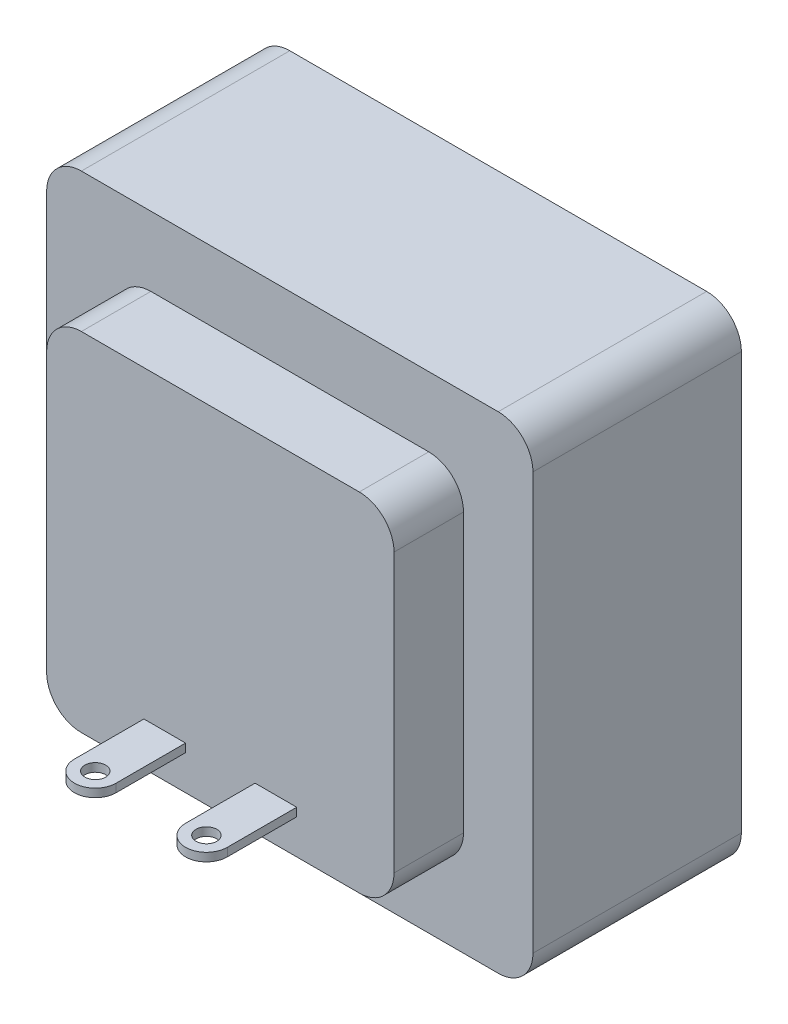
ISO-10303-21;
HEADER;
FILE_DESCRIPTION(('STEP AP214'),'2;1');
FILE_NAME('part.step','',(''),(''),'','','');
FILE_SCHEMA(('AUTOMOTIVE_DESIGN { 1 0 10303 214 1 1 1 1 }'));
ENDSEC;
DATA;
#1=APPLICATION_CONTEXT('core data for automotive mechanical design processes');
#2=APPLICATION_PROTOCOL_DEFINITION('international standard','automotive_design',2000,#1);
#3=PRODUCT_CONTEXT('',#1,'mechanical');
#4=PRODUCT('Part','Part','',(#3));
#5=PRODUCT_RELATED_PRODUCT_CATEGORY('part','',(#4));
#6=PRODUCT_DEFINITION_FORMATION('','',#4);
#7=PRODUCT_DEFINITION_CONTEXT('part definition',#1,'design');
#8=PRODUCT_DEFINITION('design','',#6,#7);
#9=PRODUCT_DEFINITION_SHAPE('','',#8);
#10=(LENGTH_UNIT() NAMED_UNIT(*) SI_UNIT(.MILLI.,.METRE.));
#11=(NAMED_UNIT(*) PLANE_ANGLE_UNIT() SI_UNIT($,.RADIAN.));
#12=(NAMED_UNIT(*) SI_UNIT($,.STERADIAN.) SOLID_ANGLE_UNIT());
#13=UNCERTAINTY_MEASURE_WITH_UNIT(LENGTH_MEASURE(1.E-05),#10,'distance_accuracy_value','');
#14=(GEOMETRIC_REPRESENTATION_CONTEXT(3) GLOBAL_UNCERTAINTY_ASSIGNED_CONTEXT((#13)) GLOBAL_UNIT_ASSIGNED_CONTEXT((#10,
#11,#12)) REPRESENTATION_CONTEXT('',''));
#15=CARTESIAN_POINT('',(0.,0.,0.));
#16=DIRECTION('',(0.,0.,1.));
#17=DIRECTION('',(1.,0.,0.));
#18=AXIS2_PLACEMENT_3D('',#15,#16,#17);
#19=CARTESIAN_POINT('',(67.1262806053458,15.875,15.875));
#20=DIRECTION('',(0.,0.,-1.));
#21=DIRECTION('',(-1.,0.,0.));
#22=AXIS2_PLACEMENT_3D('',#19,#20,#21);
#23=PLANE('',#22);
#24=DIRECTION('',(0.,-1.,0.));
#25=VECTOR('',#24,1.);
#26=CARTESIAN_POINT('',(-6.985,-12.7,15.875));
#27=LINE('',#26,#25);
#28=CARTESIAN_POINT('',(-6.985,-11.938,15.875));
#29=VERTEX_POINT('',#28);
#30=CARTESIAN_POINT('',(-6.985,-12.7,15.875));
#31=VERTEX_POINT('',#30);
#32=EDGE_CURVE('E300',#29,#31,#27,.T.);
#33=ORIENTED_EDGE('',*,*,#32,.F.);
#34=DIRECTION('',(-1.,0.,0.));
#35=VECTOR('',#34,1.);
#36=CARTESIAN_POINT('',(-6.985,-11.938,15.875));
#37=LINE('',#36,#35);
#38=CARTESIAN_POINT('',(-3.175,-11.938,15.875));
#39=VERTEX_POINT('',#38);
#40=EDGE_CURVE('E306',#39,#29,#37,.T.);
#41=ORIENTED_EDGE('',*,*,#40,.F.);
#42=DIRECTION('',(0.,1.,0.));
#43=VECTOR('',#42,1.);
#44=CARTESIAN_POINT('',(-3.175,-12.7,15.875));
#45=LINE('',#44,#43);
#46=CARTESIAN_POINT('',(-3.175,-12.7,15.875));
#47=VERTEX_POINT('',#46);
#48=EDGE_CURVE('E304',#47,#39,#45,.T.);
#49=ORIENTED_EDGE('',*,*,#48,.F.);
#50=DIRECTION('',(1.,0.,0.));
#51=VECTOR('',#50,1.);
#52=CARTESIAN_POINT('',(-6.985,-12.7,15.875));
#53=LINE('',#52,#51);
#54=EDGE_CURVE('E257',#31,#47,#53,.T.);
#55=ORIENTED_EDGE('',*,*,#54,.F.);
#56=EDGE_LOOP('',(#33,#41,#49,#55));
#57=FACE_BOUND('',#56,.T.);
#58=DIRECTION('',(0.,1.,0.));
#59=VECTOR('',#58,1.);
#60=CARTESIAN_POINT('',(-15.875,15.875,15.875));
#61=LINE('',#60,#59);
#62=CARTESIAN_POINT('',(-15.875,-12.7,15.875));
#63=VERTEX_POINT('',#62);
#64=CARTESIAN_POINT('',(-15.875,12.7,15.875));
#65=VERTEX_POINT('',#64);
#66=EDGE_CURVE('E317',#63,#65,#61,.T.);
#67=ORIENTED_EDGE('',*,*,#66,.F.);
#68=CARTESIAN_POINT('',(-12.7,-12.7,15.875));
#69=DIRECTION('',(0.,0.,-1.));
#70=DIRECTION('',(-1.,0.,0.));
#71=AXIS2_PLACEMENT_3D('',#68,#69,#70);
#72=CIRCLE('',#71,3.175);
#73=CARTESIAN_POINT('',(-12.7,-15.875,15.875));
#74=VERTEX_POINT('',#73);
#75=EDGE_CURVE('E448',#63,#74,#72,.F.);
#76=ORIENTED_EDGE('',*,*,#75,.T.);
#77=DIRECTION('',(-1.,0.,0.));
#78=VECTOR('',#77,1.);
#79=CARTESIAN_POINT('',(67.1262806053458,-15.875,15.875));
#80=LINE('',#79,#78);
#81=CARTESIAN_POINT('',(12.7,-15.875,15.875));
#82=VERTEX_POINT('',#81);
#83=EDGE_CURVE('E325',#82,#74,#80,.T.);
#84=ORIENTED_EDGE('',*,*,#83,.F.);
#85=CARTESIAN_POINT('',(12.7,-12.7,15.875));
#86=DIRECTION('',(0.,0.,-1.));
#87=DIRECTION('',(-1.,0.,0.));
#88=AXIS2_PLACEMENT_3D('',#85,#86,#87);
#89=CIRCLE('',#88,3.175);
#90=CARTESIAN_POINT('',(15.875,-12.7,15.875));
#91=VERTEX_POINT('',#90);
#92=EDGE_CURVE('E446',#82,#91,#89,.F.);
#93=ORIENTED_EDGE('',*,*,#92,.T.);
#94=DIRECTION('',(0.,1.,0.));
#95=VECTOR('',#94,1.);
#96=CARTESIAN_POINT('',(15.875,15.875,15.875));
#97=LINE('',#96,#95);
#98=CARTESIAN_POINT('',(15.875,12.7,15.875));
#99=VERTEX_POINT('',#98);
#100=EDGE_CURVE('E324',#91,#99,#97,.T.);
#101=ORIENTED_EDGE('',*,*,#100,.T.);
#102=CARTESIAN_POINT('',(12.7,12.7,15.875));
#103=DIRECTION('',(0.,0.,-1.));
#104=DIRECTION('',(-1.,0.,0.));
#105=AXIS2_PLACEMENT_3D('',#102,#103,#104);
#106=CIRCLE('',#105,3.175);
#107=CARTESIAN_POINT('',(12.7,15.875,15.875));
#108=VERTEX_POINT('',#107);
#109=EDGE_CURVE('E442',#99,#108,#106,.F.);
#110=ORIENTED_EDGE('',*,*,#109,.T.);
#111=DIRECTION('',(-1.,0.,0.));
#112=VECTOR('',#111,1.);
#113=CARTESIAN_POINT('',(67.1262806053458,15.875,15.875));
#114=LINE('',#113,#112);
#115=CARTESIAN_POINT('',(-12.7,15.875,15.875));
#116=VERTEX_POINT('',#115);
#117=EDGE_CURVE('E320',#108,#116,#114,.T.);
#118=ORIENTED_EDGE('',*,*,#117,.T.);
#119=CARTESIAN_POINT('',(-12.7,12.7,15.875));
#120=DIRECTION('',(0.,0.,-1.));
#121=DIRECTION('',(-1.,0.,0.));
#122=AXIS2_PLACEMENT_3D('',#119,#120,#121);
#123=CIRCLE('',#122,3.175);
#124=EDGE_CURVE('E444',#116,#65,#123,.F.);
#125=ORIENTED_EDGE('',*,*,#124,.T.);
#126=EDGE_LOOP('',(#67,#76,#84,#93,#101,#110,#118,#125));
#127=FACE_BOUND('',#126,.T.);
#128=DIRECTION('',(1.,0.,0.));
#129=VECTOR('',#128,1.);
#130=CARTESIAN_POINT('',(6.985,-12.7,15.875));
#131=LINE('',#130,#129);
#132=CARTESIAN_POINT('',(3.175,-12.7,15.875));
#133=VERTEX_POINT('',#132);
#134=CARTESIAN_POINT('',(6.985,-12.7,15.875));
#135=VERTEX_POINT('',#134);
#136=EDGE_CURVE('E274',#133,#135,#131,.T.);
#137=ORIENTED_EDGE('',*,*,#136,.F.);
#138=DIRECTION('',(0.,-1.,0.));
#139=VECTOR('',#138,1.);
#140=CARTESIAN_POINT('',(3.175,-12.7,15.875));
#141=LINE('',#140,#139);
#142=CARTESIAN_POINT('',(3.175,-11.938,15.875));
#143=VERTEX_POINT('',#142);
#144=EDGE_CURVE('E280',#143,#133,#141,.T.);
#145=ORIENTED_EDGE('',*,*,#144,.F.);
#146=DIRECTION('',(-1.,0.,0.));
#147=VECTOR('',#146,1.);
#148=CARTESIAN_POINT('',(6.985,-11.938,15.875));
#149=LINE('',#148,#147);
#150=CARTESIAN_POINT('',(6.985,-11.938,15.875));
#151=VERTEX_POINT('',#150);
#152=EDGE_CURVE('E50',#151,#143,#149,.T.);
#153=ORIENTED_EDGE('',*,*,#152,.F.);
#154=DIRECTION('',(0.,1.,0.));
#155=VECTOR('',#154,1.);
#156=CARTESIAN_POINT('',(6.985,-12.7,15.875));
#157=LINE('',#156,#155);
#158=EDGE_CURVE('E45',#135,#151,#157,.T.);
#159=ORIENTED_EDGE('',*,*,#158,.F.);
#160=EDGE_LOOP('',(#137,#145,#153,#159));
#161=FACE_BOUND('',#160,.T.);
#162=ADVANCED_FACE('F30',(#57,#127,#161),#23,.F.);
#163=CARTESIAN_POINT('',(-22.225,-22.225,9.525));
#164=DIRECTION('',(0.,0.,1.));
#165=DIRECTION('',(1.,0.,0.));
#166=AXIS2_PLACEMENT_3D('',#163,#164,#165);
#167=PLANE('',#166);
#168=DIRECTION('',(0.,-1.,0.));
#169=VECTOR('',#168,1.);
#170=CARTESIAN_POINT('',(-22.225,22.225,9.525));
#171=LINE('',#170,#169);
#172=CARTESIAN_POINT('',(-22.225,19.05,9.525));
#173=VERTEX_POINT('',#172);
#174=CARTESIAN_POINT('',(-22.225,-19.05,9.525));
#175=VERTEX_POINT('',#174);
#176=EDGE_CURVE('E362',#173,#175,#171,.T.);
#177=ORIENTED_EDGE('',*,*,#176,.T.);
#178=CARTESIAN_POINT('',(-19.05,-19.05,9.525));
#179=DIRECTION('',(0.,0.,1.));
#180=DIRECTION('',(1.,0.,0.));
#181=AXIS2_PLACEMENT_3D('',#178,#179,#180);
#182=CIRCLE('',#181,3.175);
#183=CARTESIAN_POINT('',(-19.05,-22.225,9.525));
#184=VERTEX_POINT('',#183);
#185=EDGE_CURVE('E410',#175,#184,#182,.T.);
#186=ORIENTED_EDGE('',*,*,#185,.T.);
#187=DIRECTION('',(1.,0.,0.));
#188=VECTOR('',#187,1.);
#189=CARTESIAN_POINT('',(-22.225,-22.225,9.525));
#190=LINE('',#189,#188);
#191=CARTESIAN_POINT('',(19.05,-22.225,9.525));
#192=VERTEX_POINT('',#191);
#193=EDGE_CURVE('E365',#184,#192,#190,.T.);
#194=ORIENTED_EDGE('',*,*,#193,.T.);
#195=CARTESIAN_POINT('',(19.05,-19.05,9.525));
#196=DIRECTION('',(0.,0.,1.));
#197=DIRECTION('',(1.,0.,0.));
#198=AXIS2_PLACEMENT_3D('',#195,#196,#197);
#199=CIRCLE('',#198,3.175);
#200=CARTESIAN_POINT('',(22.225,-19.05,9.525));
#201=VERTEX_POINT('',#200);
#202=EDGE_CURVE('E408',#192,#201,#199,.T.);
#203=ORIENTED_EDGE('',*,*,#202,.T.);
#204=DIRECTION('',(0.,1.,0.));
#205=VECTOR('',#204,1.);
#206=CARTESIAN_POINT('',(22.225,22.225,9.525));
#207=LINE('',#206,#205);
#208=CARTESIAN_POINT('',(22.225,19.05,9.525));
#209=VERTEX_POINT('',#208);
#210=EDGE_CURVE('E368',#201,#209,#207,.T.);
#211=ORIENTED_EDGE('',*,*,#210,.T.);
#212=CARTESIAN_POINT('',(19.05,19.05,9.525));
#213=DIRECTION('',(0.,0.,1.));
#214=DIRECTION('',(1.,0.,0.));
#215=AXIS2_PLACEMENT_3D('',#212,#213,#214);
#216=CIRCLE('',#215,3.175);
#217=CARTESIAN_POINT('',(19.05,22.225,9.525));
#218=VERTEX_POINT('',#217);
#219=EDGE_CURVE('E404',#209,#218,#216,.T.);
#220=ORIENTED_EDGE('',*,*,#219,.T.);
#221=DIRECTION('',(-1.,0.,0.));
#222=VECTOR('',#221,1.);
#223=CARTESIAN_POINT('',(-22.225,22.225,9.525));
#224=LINE('',#223,#222);
#225=CARTESIAN_POINT('',(-19.05,22.225,9.525));
#226=VERTEX_POINT('',#225);
#227=EDGE_CURVE('E371',#218,#226,#224,.T.);
#228=ORIENTED_EDGE('',*,*,#227,.T.);
#229=CARTESIAN_POINT('',(-19.05,19.05,9.525));
#230=DIRECTION('',(0.,0.,1.));
#231=DIRECTION('',(1.,0.,0.));
#232=AXIS2_PLACEMENT_3D('',#229,#230,#231);
#233=CIRCLE('',#232,3.175);
#234=EDGE_CURVE('E406',#226,#173,#233,.T.);
#235=ORIENTED_EDGE('',*,*,#234,.T.);
#236=EDGE_LOOP('',(#177,#186,#194,#203,#211,#220,#228,#235));
#237=FACE_BOUND('',#236,.T.);
#238=DIRECTION('',(0.,1.,0.));
#239=VECTOR('',#238,1.);
#240=CARTESIAN_POINT('',(-15.875,-22.225,9.525));
#241=LINE('',#240,#239);
#242=CARTESIAN_POINT('',(-15.875,-12.7,9.525));
#243=VERTEX_POINT('',#242);
#244=CARTESIAN_POINT('',(-15.875,12.7,9.525));
#245=VERTEX_POINT('',#244);
#246=EDGE_CURVE('E328',#243,#245,#241,.T.);
#247=ORIENTED_EDGE('',*,*,#246,.T.);
#248=CARTESIAN_POINT('',(-12.7,12.7,9.525));
#249=DIRECTION('',(0.,0.,1.));
#250=DIRECTION('',(1.,0.,0.));
#251=AXIS2_PLACEMENT_3D('',#248,#249,#250);
#252=CIRCLE('',#251,3.175);
#253=CARTESIAN_POINT('',(-12.7,15.875,9.525));
#254=VERTEX_POINT('',#253);
#255=EDGE_CURVE('E488',#245,#254,#252,.F.);
#256=ORIENTED_EDGE('',*,*,#255,.T.);
#257=DIRECTION('',(1.,0.,0.));
#258=VECTOR('',#257,1.);
#259=CARTESIAN_POINT('',(-22.225,15.875,9.525));
#260=LINE('',#259,#258);
#261=CARTESIAN_POINT('',(12.7,15.875,9.525));
#262=VERTEX_POINT('',#261);
#263=EDGE_CURVE('E347',#254,#262,#260,.T.);
#264=ORIENTED_EDGE('',*,*,#263,.T.);
#265=CARTESIAN_POINT('',(12.7,12.7,9.525));
#266=DIRECTION('',(0.,0.,1.));
#267=DIRECTION('',(1.,0.,0.));
#268=AXIS2_PLACEMENT_3D('',#265,#266,#267);
#269=CIRCLE('',#268,3.175);
#270=CARTESIAN_POINT('',(15.875,12.7,9.525));
#271=VERTEX_POINT('',#270);
#272=EDGE_CURVE('E38',#262,#271,#269,.F.);
#273=ORIENTED_EDGE('',*,*,#272,.T.);
#274=DIRECTION('',(0.,-1.,0.));
#275=VECTOR('',#274,1.);
#276=CARTESIAN_POINT('',(15.875,-22.225,9.525));
#277=LINE('',#276,#275);
#278=CARTESIAN_POINT('',(15.875,-12.7,9.525));
#279=VERTEX_POINT('',#278);
#280=EDGE_CURVE('E341',#271,#279,#277,.T.);
#281=ORIENTED_EDGE('',*,*,#280,.T.);
#282=CARTESIAN_POINT('',(12.7,-12.7,9.525));
#283=DIRECTION('',(0.,0.,1.));
#284=DIRECTION('',(1.,0.,0.));
#285=AXIS2_PLACEMENT_3D('',#282,#283,#284);
#286=CIRCLE('',#285,3.175);
#287=CARTESIAN_POINT('',(12.7,-15.875,9.525));
#288=VERTEX_POINT('',#287);
#289=EDGE_CURVE('E484',#279,#288,#286,.F.);
#290=ORIENTED_EDGE('',*,*,#289,.T.);
#291=DIRECTION('',(-1.,0.,0.));
#292=VECTOR('',#291,1.);
#293=CARTESIAN_POINT('',(-22.225,-15.875,9.525));
#294=LINE('',#293,#292);
#295=CARTESIAN_POINT('',(-12.7,-15.875,9.525));
#296=VERTEX_POINT('',#295);
#297=EDGE_CURVE('E344',#288,#296,#294,.T.);
#298=ORIENTED_EDGE('',*,*,#297,.T.);
#299=CARTESIAN_POINT('',(-12.7,-12.7,9.525));
#300=DIRECTION('',(0.,0.,1.));
#301=DIRECTION('',(1.,0.,0.));
#302=AXIS2_PLACEMENT_3D('',#299,#300,#301);
#303=CIRCLE('',#302,3.175);
#304=EDGE_CURVE('E480',#296,#243,#303,.F.);
#305=ORIENTED_EDGE('',*,*,#304,.T.);
#306=EDGE_LOOP('',(#247,#256,#264,#273,#281,#290,#298,#305));
#307=FACE_BOUND('',#306,.T.);
#308=ADVANCED_FACE('F491',(#237,#307),#167,.T.);
#309=CARTESIAN_POINT('',(-22.225,-22.225,-9.525));
#310=DIRECTION('',(0.,0.,1.));
#311=DIRECTION('',(1.,0.,0.));
#312=AXIS2_PLACEMENT_3D('',#309,#310,#311);
#313=PLANE('',#312);
#314=DIRECTION('',(1.,0.,0.));
#315=VECTOR('',#314,1.);
#316=CARTESIAN_POINT('',(-22.225,-22.225,-9.525));
#317=LINE('',#316,#315);
#318=CARTESIAN_POINT('',(-19.05,-22.225,-9.525));
#319=VERTEX_POINT('',#318);
#320=CARTESIAN_POINT('',(19.05,-22.225,-9.525));
#321=VERTEX_POINT('',#320);
#322=EDGE_CURVE('E353',#319,#321,#317,.T.);
#323=ORIENTED_EDGE('',*,*,#322,.F.);
#324=CARTESIAN_POINT('',(-19.05,-19.05,-9.525));
#325=DIRECTION('',(0.,0.,1.));
#326=DIRECTION('',(1.,0.,0.));
#327=AXIS2_PLACEMENT_3D('',#324,#325,#326);
#328=CIRCLE('',#327,3.175);
#329=CARTESIAN_POINT('',(-22.225,-19.05,-9.525));
#330=VERTEX_POINT('',#329);
#331=EDGE_CURVE('E397',#319,#330,#328,.F.);
#332=ORIENTED_EDGE('',*,*,#331,.T.);
#333=DIRECTION('',(0.,-1.,0.));
#334=VECTOR('',#333,1.);
#335=CARTESIAN_POINT('',(-22.225,22.225,-9.525));
#336=LINE('',#335,#334);
#337=CARTESIAN_POINT('',(-22.225,19.05,-9.525));
#338=VERTEX_POINT('',#337);
#339=EDGE_CURVE('E350',#338,#330,#336,.T.);
#340=ORIENTED_EDGE('',*,*,#339,.F.);
#341=CARTESIAN_POINT('',(-19.05,19.05,-9.525));
#342=DIRECTION('',(0.,0.,1.));
#343=DIRECTION('',(1.,0.,0.));
#344=AXIS2_PLACEMENT_3D('',#341,#342,#343);
#345=CIRCLE('',#344,3.175);
#346=CARTESIAN_POINT('',(-19.05,22.225,-9.525));
#347=VERTEX_POINT('',#346);
#348=EDGE_CURVE('E393',#338,#347,#345,.F.);
#349=ORIENTED_EDGE('',*,*,#348,.T.);
#350=DIRECTION('',(-1.,0.,0.));
#351=VECTOR('',#350,1.);
#352=CARTESIAN_POINT('',(-22.225,22.225,-9.525));
#353=LINE('',#352,#351);
#354=CARTESIAN_POINT('',(19.05,22.225,-9.525));
#355=VERTEX_POINT('',#354);
#356=EDGE_CURVE('E359',#355,#347,#353,.T.);
#357=ORIENTED_EDGE('',*,*,#356,.F.);
#358=CARTESIAN_POINT('',(19.05,19.05,-9.525));
#359=DIRECTION('',(0.,0.,1.));
#360=DIRECTION('',(1.,0.,0.));
#361=AXIS2_PLACEMENT_3D('',#358,#359,#360);
#362=CIRCLE('',#361,3.175);
#363=CARTESIAN_POINT('',(22.225,19.05,-9.525));
#364=VERTEX_POINT('',#363);
#365=EDGE_CURVE('E391',#355,#364,#362,.F.);
#366=ORIENTED_EDGE('',*,*,#365,.T.);
#367=DIRECTION('',(0.,1.,0.));
#368=VECTOR('',#367,1.);
#369=CARTESIAN_POINT('',(22.225,22.225,-9.525));
#370=LINE('',#369,#368);
#371=CARTESIAN_POINT('',(22.225,-19.05,-9.525));
#372=VERTEX_POINT('',#371);
#373=EDGE_CURVE('E356',#372,#364,#370,.T.);
#374=ORIENTED_EDGE('',*,*,#373,.F.);
#375=CARTESIAN_POINT('',(19.05,-19.05,-9.525));
#376=DIRECTION('',(0.,0.,1.));
#377=DIRECTION('',(1.,0.,0.));
#378=AXIS2_PLACEMENT_3D('',#375,#376,#377);
#379=CIRCLE('',#378,3.175);
#380=EDGE_CURVE('E395',#372,#321,#379,.F.);
#381=ORIENTED_EDGE('',*,*,#380,.T.);
#382=EDGE_LOOP('',(#323,#332,#340,#349,#357,#366,#374,#381));
#383=FACE_BOUND('',#382,.T.);
#384=DIRECTION('',(0.,-1.,0.));
#385=VECTOR('',#384,1.);
#386=CARTESIAN_POINT('',(15.875,-22.225,-9.525));
#387=LINE('',#386,#385);
#388=CARTESIAN_POINT('',(15.875,12.7,-9.525));
#389=VERTEX_POINT('',#388);
#390=CARTESIAN_POINT('',(15.875,-12.7,-9.525));
#391=VERTEX_POINT('',#390);
#392=EDGE_CURVE('E383',#389,#391,#387,.T.);
#393=ORIENTED_EDGE('',*,*,#392,.F.);
#394=CARTESIAN_POINT('',(12.7,12.7,-9.525));
#395=DIRECTION('',(0.,0.,1.));
#396=DIRECTION('',(1.,0.,0.));
#397=AXIS2_PLACEMENT_3D('',#394,#395,#396);
#398=CIRCLE('',#397,3.175);
#399=CARTESIAN_POINT('',(12.7,15.875,-9.525));
#400=VERTEX_POINT('',#399);
#401=EDGE_CURVE('E12',#389,#400,#398,.T.);
#402=ORIENTED_EDGE('',*,*,#401,.T.);
#403=DIRECTION('',(1.,0.,0.));
#404=VECTOR('',#403,1.);
#405=CARTESIAN_POINT('',(-22.225,15.875,-9.525));
#406=LINE('',#405,#404);
#407=CARTESIAN_POINT('',(-12.7,15.875,-9.525));
#408=VERTEX_POINT('',#407);
#409=EDGE_CURVE('E380',#408,#400,#406,.T.);
#410=ORIENTED_EDGE('',*,*,#409,.F.);
#411=CARTESIAN_POINT('',(-12.7,12.7,-9.525));
#412=DIRECTION('',(0.,0.,1.));
#413=DIRECTION('',(1.,0.,0.));
#414=AXIS2_PLACEMENT_3D('',#411,#412,#413);
#415=CIRCLE('',#414,3.175);
#416=CARTESIAN_POINT('',(-15.875,12.7,-9.525));
#417=VERTEX_POINT('',#416);
#418=EDGE_CURVE('E486',#408,#417,#415,.T.);
#419=ORIENTED_EDGE('',*,*,#418,.T.);
#420=DIRECTION('',(0.,1.,0.));
#421=VECTOR('',#420,1.);
#422=CARTESIAN_POINT('',(-15.875,-22.225,-9.525));
#423=LINE('',#422,#421);
#424=CARTESIAN_POINT('',(-15.875,-12.7,-9.525));
#425=VERTEX_POINT('',#424);
#426=EDGE_CURVE('E374',#425,#417,#423,.T.);
#427=ORIENTED_EDGE('',*,*,#426,.F.);
#428=CARTESIAN_POINT('',(-12.7,-12.7,-9.525));
#429=DIRECTION('',(0.,0.,1.));
#430=DIRECTION('',(1.,0.,0.));
#431=AXIS2_PLACEMENT_3D('',#428,#429,#430);
#432=CIRCLE('',#431,3.175);
#433=CARTESIAN_POINT('',(-12.7,-15.875,-9.525));
#434=VERTEX_POINT('',#433);
#435=EDGE_CURVE('E478',#425,#434,#432,.T.);
#436=ORIENTED_EDGE('',*,*,#435,.T.);
#437=DIRECTION('',(-1.,0.,0.));
#438=VECTOR('',#437,1.);
#439=CARTESIAN_POINT('',(-22.225,-15.875,-9.525));
#440=LINE('',#439,#438);
#441=CARTESIAN_POINT('',(12.7,-15.875,-9.525));
#442=VERTEX_POINT('',#441);
#443=EDGE_CURVE('E377',#442,#434,#440,.T.);
#444=ORIENTED_EDGE('',*,*,#443,.F.);
#445=CARTESIAN_POINT('',(12.7,-12.7,-9.525));
#446=DIRECTION('',(0.,0.,1.));
#447=DIRECTION('',(1.,0.,0.));
#448=AXIS2_PLACEMENT_3D('',#445,#446,#447);
#449=CIRCLE('',#448,3.175);
#450=EDGE_CURVE('E482',#442,#391,#449,.T.);
#451=ORIENTED_EDGE('',*,*,#450,.T.);
#452=EDGE_LOOP('',(#393,#402,#410,#419,#427,#436,#444,#451));
#453=FACE_BOUND('',#452,.T.);
#454=ADVANCED_FACE('F549',(#383,#453),#313,.F.);
#455=CARTESIAN_POINT('',(-22.225,22.225,9.525));
#456=DIRECTION('',(1.,0.,0.));
#457=DIRECTION('',(0.,1.,0.));
#458=AXIS2_PLACEMENT_3D('',#455,#456,#457);
#459=PLANE('',#458);
#460=ORIENTED_EDGE('',*,*,#339,.T.);
#461=DIRECTION('',(0.,0.,-1.));
#462=VECTOR('',#461,1.);
#463=CARTESIAN_POINT('',(-22.225,-19.05,9.525));
#464=LINE('',#463,#462);
#465=EDGE_CURVE('E402',#330,#175,#464,.F.);
#466=ORIENTED_EDGE('',*,*,#465,.T.);
#467=ORIENTED_EDGE('',*,*,#176,.F.);
#468=DIRECTION('',(0.,0.,-1.));
#469=VECTOR('',#468,1.);
#470=CARTESIAN_POINT('',(-22.225,19.05,9.525));
#471=LINE('',#470,#469);
#472=EDGE_CURVE('E399',#173,#338,#471,.T.);
#473=ORIENTED_EDGE('',*,*,#472,.T.);
#474=EDGE_LOOP('',(#460,#466,#467,#473));
#475=FACE_BOUND('',#474,.T.);
#476=ADVANCED_FACE('F32',(#475),#459,.F.);
#477=CARTESIAN_POINT('',(-22.225,-22.225,9.525));
#478=DIRECTION('',(0.,1.,0.));
#479=DIRECTION('',(-1.,0.,0.));
#480=AXIS2_PLACEMENT_3D('',#477,#478,#479);
#481=PLANE('',#480);
#482=ORIENTED_EDGE('',*,*,#193,.F.);
#483=DIRECTION('',(0.,0.,-1.));
#484=VECTOR('',#483,1.);
#485=CARTESIAN_POINT('',(-19.05,-22.225,9.525));
#486=LINE('',#485,#484);
#487=EDGE_CURVE('E388',#184,#319,#486,.T.);
#488=ORIENTED_EDGE('',*,*,#487,.T.);
#489=ORIENTED_EDGE('',*,*,#322,.T.);
#490=DIRECTION('',(0.,0.,-1.));
#491=VECTOR('',#490,1.);
#492=CARTESIAN_POINT('',(19.05,-22.225,9.525));
#493=LINE('',#492,#491);
#494=EDGE_CURVE('E386',#321,#192,#493,.F.);
#495=ORIENTED_EDGE('',*,*,#494,.T.);
#496=EDGE_LOOP('',(#482,#488,#489,#495));
#497=FACE_BOUND('',#496,.T.);
#498=ADVANCED_FACE('F565',(#497),#481,.F.);
#499=CARTESIAN_POINT('',(22.225,22.225,9.525));
#500=DIRECTION('',(-1.,0.,0.));
#501=DIRECTION('',(0.,-1.,0.));
#502=AXIS2_PLACEMENT_3D('',#499,#500,#501);
#503=PLANE('',#502);
#504=ORIENTED_EDGE('',*,*,#210,.F.);
#505=DIRECTION('',(0.,0.,-1.));
#506=VECTOR('',#505,1.);
#507=CARTESIAN_POINT('',(22.225,-19.05,9.525));
#508=LINE('',#507,#506);
#509=EDGE_CURVE('E414',#201,#372,#508,.T.);
#510=ORIENTED_EDGE('',*,*,#509,.T.);
#511=ORIENTED_EDGE('',*,*,#373,.T.);
#512=DIRECTION('',(0.,0.,-1.));
#513=VECTOR('',#512,1.);
#514=CARTESIAN_POINT('',(22.225,19.05,9.525));
#515=LINE('',#514,#513);
#516=EDGE_CURVE('E412',#364,#209,#515,.F.);
#517=ORIENTED_EDGE('',*,*,#516,.T.);
#518=EDGE_LOOP('',(#504,#510,#511,#517));
#519=FACE_BOUND('',#518,.T.);
#520=ADVANCED_FACE('F562',(#519),#503,.F.);
#521=CARTESIAN_POINT('',(-22.225,22.225,9.525));
#522=DIRECTION('',(0.,-1.,0.));
#523=DIRECTION('',(0.,0.,-1.));
#524=AXIS2_PLACEMENT_3D('',#521,#522,#523);
#525=PLANE('',#524);
#526=ORIENTED_EDGE('',*,*,#356,.T.);
#527=DIRECTION('',(0.,0.,-1.));
#528=VECTOR('',#527,1.);
#529=CARTESIAN_POINT('',(-19.05,22.225,9.525));
#530=LINE('',#529,#528);
#531=EDGE_CURVE('E471',#347,#226,#530,.F.);
#532=ORIENTED_EDGE('',*,*,#531,.T.);
#533=ORIENTED_EDGE('',*,*,#227,.F.);
#534=DIRECTION('',(0.,0.,-1.));
#535=VECTOR('',#534,1.);
#536=CARTESIAN_POINT('',(19.05,22.225,9.525));
#537=LINE('',#536,#535);
#538=EDGE_CURVE('E468',#218,#355,#537,.T.);
#539=ORIENTED_EDGE('',*,*,#538,.T.);
#540=EDGE_LOOP('',(#526,#532,#533,#539));
#541=FACE_BOUND('',#540,.T.);
#542=ADVANCED_FACE('F558',(#541),#525,.F.);
#543=CARTESIAN_POINT('',(67.1262806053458,15.875,-15.875));
#544=DIRECTION('',(0.,0.,1.));
#545=DIRECTION('',(0.,-1.,0.));
#546=AXIS2_PLACEMENT_3D('',#543,#544,#545);
#547=PLANE('',#546);
#548=DIRECTION('',(-1.,0.,0.));
#549=VECTOR('',#548,1.);
#550=CARTESIAN_POINT('',(67.1262806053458,-15.875,-15.875));
#551=LINE('',#550,#549);
#552=CARTESIAN_POINT('',(12.7,-15.875,-15.875));
#553=VERTEX_POINT('',#552);
#554=CARTESIAN_POINT('',(-12.7,-15.875,-15.875));
#555=VERTEX_POINT('',#554);
#556=EDGE_CURVE('E334',#553,#555,#551,.T.);
#557=ORIENTED_EDGE('',*,*,#556,.T.);
#558=CARTESIAN_POINT('',(-12.7,-12.7,-15.875));
#559=DIRECTION('',(0.,0.,1.));
#560=DIRECTION('',(0.,-1.,0.));
#561=AXIS2_PLACEMENT_3D('',#558,#559,#560);
#562=CIRCLE('',#561,3.175);
#563=CARTESIAN_POINT('',(-15.875,-12.7,-15.875));
#564=VERTEX_POINT('',#563);
#565=EDGE_CURVE('E434',#555,#564,#562,.F.);
#566=ORIENTED_EDGE('',*,*,#565,.T.);
#567=DIRECTION('',(0.,-1.,0.));
#568=VECTOR('',#567,1.);
#569=CARTESIAN_POINT('',(-15.875,15.875,-15.875));
#570=LINE('',#569,#568);
#571=CARTESIAN_POINT('',(-15.875,12.7,-15.875));
#572=VERTEX_POINT('',#571);
#573=EDGE_CURVE('E314',#572,#564,#570,.T.);
#574=ORIENTED_EDGE('',*,*,#573,.F.);
#575=CARTESIAN_POINT('',(-12.7,12.7,-15.875));
#576=DIRECTION('',(0.,0.,1.));
#577=DIRECTION('',(0.,-1.,0.));
#578=AXIS2_PLACEMENT_3D('',#575,#576,#577);
#579=CIRCLE('',#578,3.175);
#580=CARTESIAN_POINT('',(-12.7,15.875,-15.875));
#581=VERTEX_POINT('',#580);
#582=EDGE_CURVE('E430',#572,#581,#579,.F.);
#583=ORIENTED_EDGE('',*,*,#582,.T.);
#584=DIRECTION('',(-1.,0.,0.));
#585=VECTOR('',#584,1.);
#586=CARTESIAN_POINT('',(67.1262806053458,15.875,-15.875));
#587=LINE('',#586,#585);
#588=CARTESIAN_POINT('',(12.7,15.875,-15.875));
#589=VERTEX_POINT('',#588);
#590=EDGE_CURVE('E331',#589,#581,#587,.T.);
#591=ORIENTED_EDGE('',*,*,#590,.F.);
#592=CARTESIAN_POINT('',(12.7,12.7,-15.875));
#593=DIRECTION('',(0.,0.,1.));
#594=DIRECTION('',(0.,-1.,0.));
#595=AXIS2_PLACEMENT_3D('',#592,#593,#594);
#596=CIRCLE('',#595,3.175);
#597=CARTESIAN_POINT('',(15.875,12.7,-15.875));
#598=VERTEX_POINT('',#597);
#599=EDGE_CURVE('E428',#589,#598,#596,.F.);
#600=ORIENTED_EDGE('',*,*,#599,.T.);
#601=DIRECTION('',(0.,-1.,0.));
#602=VECTOR('',#601,1.);
#603=CARTESIAN_POINT('',(15.875,15.875,-15.875));
#604=LINE('',#603,#602);
#605=CARTESIAN_POINT('',(15.875,-12.7,-15.875));
#606=VERTEX_POINT('',#605);
#607=EDGE_CURVE('E321',#598,#606,#604,.T.);
#608=ORIENTED_EDGE('',*,*,#607,.T.);
#609=CARTESIAN_POINT('',(12.7,-12.7,-15.875));
#610=DIRECTION('',(0.,0.,1.));
#611=DIRECTION('',(0.,-1.,0.));
#612=AXIS2_PLACEMENT_3D('',#609,#610,#611);
#613=CIRCLE('',#612,3.175);
#614=EDGE_CURVE('E432',#606,#553,#613,.F.);
#615=ORIENTED_EDGE('',*,*,#614,.T.);
#616=EDGE_LOOP('',(#557,#566,#574,#583,#591,#600,#608,#615));
#617=FACE_BOUND('',#616,.T.);
#618=ADVANCED_FACE('F561',(#617),#547,.F.);
#619=CARTESIAN_POINT('',(-15.875,22.225,9.525));
#620=DIRECTION('',(1.,0.,0.));
#621=DIRECTION('',(0.,1.,0.));
#622=AXIS2_PLACEMENT_3D('',#619,#620,#621);
#623=PLANE('',#622);
#624=ORIENTED_EDGE('',*,*,#573,.T.);
#625=DIRECTION('',(0.,0.,1.));
#626=VECTOR('',#625,1.);
#627=CARTESIAN_POINT('',(-15.875,-12.7,9.525));
#628=LINE('',#627,#626);
#629=EDGE_CURVE('E420',#564,#425,#628,.T.);
#630=ORIENTED_EDGE('',*,*,#629,.T.);
#631=ORIENTED_EDGE('',*,*,#426,.T.);
#632=DIRECTION('',(0.,0.,-1.));
#633=VECTOR('',#632,1.);
#634=CARTESIAN_POINT('',(-15.875,12.7,9.525));
#635=LINE('',#634,#633);
#636=EDGE_CURVE('E417',#417,#572,#635,.T.);
#637=ORIENTED_EDGE('',*,*,#636,.T.);
#638=EDGE_LOOP('',(#624,#630,#631,#637));
#639=FACE_BOUND('',#638,.T.);
#640=ADVANCED_FACE('F615',(#639),#623,.F.);
#641=CARTESIAN_POINT('',(15.875,22.225,9.525));
#642=DIRECTION('',(-1.,0.,0.));
#643=DIRECTION('',(0.,-1.,0.));
#644=AXIS2_PLACEMENT_3D('',#641,#642,#643);
#645=PLANE('',#644);
#646=ORIENTED_EDGE('',*,*,#392,.T.);
#647=DIRECTION('',(0.,0.,1.));
#648=VECTOR('',#647,1.);
#649=CARTESIAN_POINT('',(15.875,-12.7,9.525));
#650=LINE('',#649,#648);
#651=EDGE_CURVE('E457',#391,#606,#650,.F.);
#652=ORIENTED_EDGE('',*,*,#651,.T.);
#653=ORIENTED_EDGE('',*,*,#607,.F.);
#654=DIRECTION('',(0.,0.,-1.));
#655=VECTOR('',#654,1.);
#656=CARTESIAN_POINT('',(15.875,12.7,9.525));
#657=LINE('',#656,#655);
#658=EDGE_CURVE('E455',#598,#389,#657,.F.);
#659=ORIENTED_EDGE('',*,*,#658,.T.);
#660=EDGE_LOOP('',(#646,#652,#653,#659));
#661=FACE_BOUND('',#660,.T.);
#662=ADVANCED_FACE('F618',(#661),#645,.F.);
#663=CARTESIAN_POINT('',(67.1262806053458,-15.875,15.875));
#664=DIRECTION('',(0.,1.,0.));
#665=DIRECTION('',(0.,0.,1.));
#666=AXIS2_PLACEMENT_3D('',#663,#664,#665);
#667=PLANE('',#666);
#668=ORIENTED_EDGE('',*,*,#443,.T.);
#669=DIRECTION('',(0.,0.,1.));
#670=VECTOR('',#669,1.);
#671=CARTESIAN_POINT('',(-12.7,-15.875,15.875));
#672=LINE('',#671,#670);
#673=EDGE_CURVE('E426',#434,#555,#672,.F.);
#674=ORIENTED_EDGE('',*,*,#673,.T.);
#675=ORIENTED_EDGE('',*,*,#556,.F.);
#676=DIRECTION('',(0.,0.,1.));
#677=VECTOR('',#676,1.);
#678=CARTESIAN_POINT('',(12.7,-15.875,15.875));
#679=LINE('',#678,#677);
#680=EDGE_CURVE('E423',#553,#442,#679,.T.);
#681=ORIENTED_EDGE('',*,*,#680,.T.);
#682=EDGE_LOOP('',(#668,#674,#675,#681));
#683=FACE_BOUND('',#682,.T.);
#684=ADVANCED_FACE('F652',(#683),#667,.F.);
#685=CARTESIAN_POINT('',(67.1262806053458,15.875,15.875));
#686=DIRECTION('',(0.,-1.,0.));
#687=DIRECTION('',(0.,0.,-1.));
#688=AXIS2_PLACEMENT_3D('',#685,#686,#687);
#689=PLANE('',#688);
#690=ORIENTED_EDGE('',*,*,#590,.T.);
#691=DIRECTION('',(0.,0.,-1.));
#692=VECTOR('',#691,1.);
#693=CARTESIAN_POINT('',(-12.7,15.875,15.875));
#694=LINE('',#693,#692);
#695=EDGE_CURVE('E466',#581,#408,#694,.F.);
#696=ORIENTED_EDGE('',*,*,#695,.T.);
#697=ORIENTED_EDGE('',*,*,#409,.T.);
#698=DIRECTION('',(0.,0.,-1.));
#699=VECTOR('',#698,1.);
#700=CARTESIAN_POINT('',(12.7,15.875,15.875));
#701=LINE('',#700,#699);
#702=EDGE_CURVE('E463',#400,#589,#701,.T.);
#703=ORIENTED_EDGE('',*,*,#702,.T.);
#704=EDGE_LOOP('',(#690,#696,#697,#703));
#705=FACE_BOUND('',#704,.T.);
#706=ADVANCED_FACE('F620',(#705),#689,.F.);
#707=ORIENTED_EDGE('',*,*,#263,.F.);
#708=DIRECTION('',(0.,0.,-1.));
#709=VECTOR('',#708,1.);
#710=CARTESIAN_POINT('',(-12.7,15.875,15.875));
#711=LINE('',#710,#709);
#712=EDGE_CURVE('E476',#254,#116,#711,.F.);
#713=ORIENTED_EDGE('',*,*,#712,.T.);
#714=ORIENTED_EDGE('',*,*,#117,.F.);
#715=DIRECTION('',(0.,0.,-1.));
#716=VECTOR('',#715,1.);
#717=CARTESIAN_POINT('',(12.7,15.875,15.875));
#718=LINE('',#717,#716);
#719=EDGE_CURVE('E473',#108,#262,#718,.T.);
#720=ORIENTED_EDGE('',*,*,#719,.T.);
#721=EDGE_LOOP('',(#707,#713,#714,#720));
#722=FACE_BOUND('',#721,.T.);
#723=ADVANCED_FACE('F508',(#722),#689,.F.);
#724=ORIENTED_EDGE('',*,*,#83,.T.);
#725=DIRECTION('',(0.,0.,1.));
#726=VECTOR('',#725,1.);
#727=CARTESIAN_POINT('',(-12.7,-15.875,15.875));
#728=LINE('',#727,#726);
#729=EDGE_CURVE('E453',#74,#296,#728,.F.);
#730=ORIENTED_EDGE('',*,*,#729,.T.);
#731=ORIENTED_EDGE('',*,*,#297,.F.);
#732=DIRECTION('',(0.,0.,1.));
#733=VECTOR('',#732,1.);
#734=CARTESIAN_POINT('',(12.7,-15.875,15.875));
#735=LINE('',#734,#733);
#736=EDGE_CURVE('E450',#288,#82,#735,.T.);
#737=ORIENTED_EDGE('',*,*,#736,.T.);
#738=EDGE_LOOP('',(#724,#730,#731,#737));
#739=FACE_BOUND('',#738,.T.);
#740=ADVANCED_FACE('F523',(#739),#667,.F.);
#741=ORIENTED_EDGE('',*,*,#100,.F.);
#742=DIRECTION('',(0.,0.,1.));
#743=VECTOR('',#742,1.);
#744=CARTESIAN_POINT('',(15.875,-12.7,9.525));
#745=LINE('',#744,#743);
#746=EDGE_CURVE('E461',#91,#279,#745,.F.);
#747=ORIENTED_EDGE('',*,*,#746,.T.);
#748=ORIENTED_EDGE('',*,*,#280,.F.);
#749=DIRECTION('',(0.,0.,-1.));
#750=VECTOR('',#749,1.);
#751=CARTESIAN_POINT('',(15.875,12.7,9.525));
#752=LINE('',#751,#750);
#753=EDGE_CURVE('E459',#271,#99,#752,.F.);
#754=ORIENTED_EDGE('',*,*,#753,.T.);
#755=EDGE_LOOP('',(#741,#747,#748,#754));
#756=FACE_BOUND('',#755,.T.);
#757=ADVANCED_FACE('F499',(#756),#645,.F.);
#758=ORIENTED_EDGE('',*,*,#246,.F.);
#759=DIRECTION('',(0.,0.,1.));
#760=VECTOR('',#759,1.);
#761=CARTESIAN_POINT('',(-15.875,-12.7,9.525));
#762=LINE('',#761,#760);
#763=EDGE_CURVE('E439',#243,#63,#762,.T.);
#764=ORIENTED_EDGE('',*,*,#763,.T.);
#765=ORIENTED_EDGE('',*,*,#66,.T.);
#766=DIRECTION('',(0.,0.,-1.));
#767=VECTOR('',#766,1.);
#768=CARTESIAN_POINT('',(-15.875,12.7,9.525));
#769=LINE('',#768,#767);
#770=EDGE_CURVE('E436',#65,#245,#769,.T.);
#771=ORIENTED_EDGE('',*,*,#770,.T.);
#772=EDGE_LOOP('',(#758,#764,#765,#771));
#773=FACE_BOUND('',#772,.T.);
#774=ADVANCED_FACE('F515',(#773),#623,.F.);
#775=CARTESIAN_POINT('',(-19.05,-19.05,9.525));
#776=DIRECTION('',(0.,0.,-1.));
#777=DIRECTION('',(-1.,0.,0.));
#778=AXIS2_PLACEMENT_3D('',#775,#776,#777);
#779=CYLINDRICAL_SURFACE('',#778,3.175);
#780=ORIENTED_EDGE('',*,*,#185,.F.);
#781=ORIENTED_EDGE('',*,*,#465,.F.);
#782=ORIENTED_EDGE('',*,*,#331,.F.);
#783=ORIENTED_EDGE('',*,*,#487,.F.);
#784=EDGE_LOOP('',(#780,#781,#782,#783));
#785=FACE_BOUND('',#784,.T.);
#786=ADVANCED_FACE('F580',(#785),#779,.T.);
#787=CARTESIAN_POINT('',(19.05,-19.05,9.525));
#788=DIRECTION('',(0.,0.,-1.));
#789=DIRECTION('',(-1.,0.,0.));
#790=AXIS2_PLACEMENT_3D('',#787,#788,#789);
#791=CYLINDRICAL_SURFACE('',#790,3.175);
#792=ORIENTED_EDGE('',*,*,#202,.F.);
#793=ORIENTED_EDGE('',*,*,#494,.F.);
#794=ORIENTED_EDGE('',*,*,#380,.F.);
#795=ORIENTED_EDGE('',*,*,#509,.F.);
#796=EDGE_LOOP('',(#792,#793,#794,#795));
#797=FACE_BOUND('',#796,.T.);
#798=ADVANCED_FACE('F600',(#797),#791,.T.);
#799=CARTESIAN_POINT('',(-12.7,-12.7,9.525));
#800=DIRECTION('',(0.,0.,1.));
#801=DIRECTION('',(0.,-1.,0.));
#802=AXIS2_PLACEMENT_3D('',#799,#800,#801);
#803=CYLINDRICAL_SURFACE('',#802,3.175);
#804=ORIENTED_EDGE('',*,*,#565,.F.);
#805=ORIENTED_EDGE('',*,*,#673,.F.);
#806=ORIENTED_EDGE('',*,*,#435,.F.);
#807=ORIENTED_EDGE('',*,*,#629,.F.);
#808=EDGE_LOOP('',(#804,#805,#806,#807));
#809=FACE_BOUND('',#808,.T.);
#810=ADVANCED_FACE('F602',(#809),#803,.T.);
#811=CARTESIAN_POINT('',(-12.7,-12.7,9.525));
#812=DIRECTION('',(0.,0.,1.));
#813=DIRECTION('',(0.,-1.,0.));
#814=AXIS2_PLACEMENT_3D('',#811,#812,#813);
#815=CYLINDRICAL_SURFACE('',#814,3.175);
#816=ORIENTED_EDGE('',*,*,#304,.F.);
#817=ORIENTED_EDGE('',*,*,#729,.F.);
#818=ORIENTED_EDGE('',*,*,#75,.F.);
#819=ORIENTED_EDGE('',*,*,#763,.F.);
#820=EDGE_LOOP('',(#816,#817,#818,#819));
#821=FACE_BOUND('',#820,.T.);
#822=ADVANCED_FACE('F519',(#821),#815,.T.);
#823=CARTESIAN_POINT('',(12.7,-12.7,15.875));
#824=DIRECTION('',(0.,0.,1.));
#825=DIRECTION('',(0.,-1.,0.));
#826=AXIS2_PLACEMENT_3D('',#823,#824,#825);
#827=CYLINDRICAL_SURFACE('',#826,3.175);
#828=ORIENTED_EDGE('',*,*,#614,.F.);
#829=ORIENTED_EDGE('',*,*,#651,.F.);
#830=ORIENTED_EDGE('',*,*,#450,.F.);
#831=ORIENTED_EDGE('',*,*,#680,.F.);
#832=EDGE_LOOP('',(#828,#829,#830,#831));
#833=FACE_BOUND('',#832,.T.);
#834=ADVANCED_FACE('F530',(#833),#827,.T.);
#835=CARTESIAN_POINT('',(12.7,-12.7,15.875));
#836=DIRECTION('',(0.,0.,1.));
#837=DIRECTION('',(0.,-1.,0.));
#838=AXIS2_PLACEMENT_3D('',#835,#836,#837);
#839=CYLINDRICAL_SURFACE('',#838,3.175);
#840=ORIENTED_EDGE('',*,*,#289,.F.);
#841=ORIENTED_EDGE('',*,*,#746,.F.);
#842=ORIENTED_EDGE('',*,*,#92,.F.);
#843=ORIENTED_EDGE('',*,*,#736,.F.);
#844=EDGE_LOOP('',(#840,#841,#842,#843));
#845=FACE_BOUND('',#844,.T.);
#846=ADVANCED_FACE('F527',(#845),#839,.T.);
#847=CARTESIAN_POINT('',(-12.7,12.7,9.525));
#848=DIRECTION('',(0.,0.,-1.));
#849=DIRECTION('',(-1.,0.,0.));
#850=AXIS2_PLACEMENT_3D('',#847,#848,#849);
#851=CYLINDRICAL_SURFACE('',#850,3.175);
#852=ORIENTED_EDGE('',*,*,#418,.F.);
#853=ORIENTED_EDGE('',*,*,#695,.F.);
#854=ORIENTED_EDGE('',*,*,#582,.F.);
#855=ORIENTED_EDGE('',*,*,#636,.F.);
#856=EDGE_LOOP('',(#852,#853,#854,#855));
#857=FACE_BOUND('',#856,.T.);
#858=ADVANCED_FACE('F529',(#857),#851,.T.);
#859=CARTESIAN_POINT('',(-19.05,19.05,9.525));
#860=DIRECTION('',(0.,0.,-1.));
#861=DIRECTION('',(-1.,0.,0.));
#862=AXIS2_PLACEMENT_3D('',#859,#860,#861);
#863=CYLINDRICAL_SURFACE('',#862,3.175);
#864=ORIENTED_EDGE('',*,*,#234,.F.);
#865=ORIENTED_EDGE('',*,*,#531,.F.);
#866=ORIENTED_EDGE('',*,*,#348,.F.);
#867=ORIENTED_EDGE('',*,*,#472,.F.);
#868=EDGE_LOOP('',(#864,#865,#866,#867));
#869=FACE_BOUND('',#868,.T.);
#870=ADVANCED_FACE('F536',(#869),#863,.T.);
#871=CARTESIAN_POINT('',(-12.7,12.7,9.525));
#872=DIRECTION('',(0.,0.,-1.));
#873=DIRECTION('',(-1.,0.,0.));
#874=AXIS2_PLACEMENT_3D('',#871,#872,#873);
#875=CYLINDRICAL_SURFACE('',#874,3.175);
#876=ORIENTED_EDGE('',*,*,#124,.F.);
#877=ORIENTED_EDGE('',*,*,#712,.F.);
#878=ORIENTED_EDGE('',*,*,#255,.F.);
#879=ORIENTED_EDGE('',*,*,#770,.F.);
#880=EDGE_LOOP('',(#876,#877,#878,#879));
#881=FACE_BOUND('',#880,.T.);
#882=ADVANCED_FACE('F511',(#881),#875,.T.);
#883=CARTESIAN_POINT('',(12.7,12.7,15.875));
#884=DIRECTION('',(0.,0.,-1.));
#885=DIRECTION('',(-1.,0.,0.));
#886=AXIS2_PLACEMENT_3D('',#883,#884,#885);
#887=CYLINDRICAL_SURFACE('',#886,3.175);
#888=ORIENTED_EDGE('',*,*,#109,.F.);
#889=ORIENTED_EDGE('',*,*,#753,.F.);
#890=ORIENTED_EDGE('',*,*,#272,.F.);
#891=ORIENTED_EDGE('',*,*,#719,.F.);
#892=EDGE_LOOP('',(#888,#889,#890,#891));
#893=FACE_BOUND('',#892,.T.);
#894=ADVANCED_FACE('F502',(#893),#887,.T.);
#895=CARTESIAN_POINT('',(19.05,19.05,9.525));
#896=DIRECTION('',(0.,0.,-1.));
#897=DIRECTION('',(-1.,0.,0.));
#898=AXIS2_PLACEMENT_3D('',#895,#896,#897);
#899=CYLINDRICAL_SURFACE('',#898,3.175);
#900=ORIENTED_EDGE('',*,*,#219,.F.);
#901=ORIENTED_EDGE('',*,*,#516,.F.);
#902=ORIENTED_EDGE('',*,*,#365,.F.);
#903=ORIENTED_EDGE('',*,*,#538,.F.);
#904=EDGE_LOOP('',(#900,#901,#902,#903));
#905=FACE_BOUND('',#904,.T.);
#906=ADVANCED_FACE('F594',(#905),#899,.T.);
#907=CARTESIAN_POINT('',(12.7,12.7,15.875));
#908=DIRECTION('',(0.,0.,-1.));
#909=DIRECTION('',(-1.,0.,0.));
#910=AXIS2_PLACEMENT_3D('',#907,#908,#909);
#911=CYLINDRICAL_SURFACE('',#910,3.175);
#912=ORIENTED_EDGE('',*,*,#401,.F.);
#913=ORIENTED_EDGE('',*,*,#658,.F.);
#914=ORIENTED_EDGE('',*,*,#599,.F.);
#915=ORIENTED_EDGE('',*,*,#702,.F.);
#916=EDGE_LOOP('',(#912,#913,#914,#915));
#917=FACE_BOUND('',#916,.T.);
#918=ADVANCED_FACE('F647',(#917),#911,.T.);
#919=CARTESIAN_POINT('',(-6.985,-12.7,22.225));
#920=DIRECTION('',(1.,0.,0.));
#921=DIRECTION('',(0.,1.,0.));
#922=AXIS2_PLACEMENT_3D('',#919,#920,#921);
#923=PLANE('',#922);
#924=ORIENTED_EDGE('',*,*,#32,.T.);
#925=DIRECTION('',(0.,0.,-1.));
#926=VECTOR('',#925,1.);
#927=CARTESIAN_POINT('',(-6.985,-12.7,22.225));
#928=LINE('',#927,#926);
#929=CARTESIAN_POINT('',(-6.985,-12.7,22.225));
#930=VERTEX_POINT('',#929);
#931=EDGE_CURVE('E258',#930,#31,#928,.T.);
#932=ORIENTED_EDGE('',*,*,#931,.F.);
#933=DIRECTION('',(0.,-1.,0.));
#934=VECTOR('',#933,1.);
#935=CARTESIAN_POINT('',(-6.985,-12.7,22.225));
#936=LINE('',#935,#934);
#937=CARTESIAN_POINT('',(-6.985,-11.938,22.225));
#938=VERTEX_POINT('',#937);
#939=EDGE_CURVE('E248',#938,#930,#936,.T.);
#940=ORIENTED_EDGE('',*,*,#939,.F.);
#941=DIRECTION('',(0.,0.,-1.));
#942=VECTOR('',#941,1.);
#943=CARTESIAN_POINT('',(-6.985,-11.938,22.225));
#944=LINE('',#943,#942);
#945=EDGE_CURVE('E247',#938,#29,#944,.T.);
#946=ORIENTED_EDGE('',*,*,#945,.T.);
#947=EDGE_LOOP('',(#924,#932,#940,#946));
#948=FACE_BOUND('',#947,.T.);
#949=ADVANCED_FACE('F725',(#948),#923,.F.);
#950=CARTESIAN_POINT('',(-6.985,-12.7,22.225));
#951=DIRECTION('',(0.,1.,0.));
#952=DIRECTION('',(0.,0.,1.));
#953=AXIS2_PLACEMENT_3D('',#950,#951,#952);
#954=PLANE('',#953);
#955=CARTESIAN_POINT('',(-5.08,-12.7,22.225));
#956=DIRECTION('',(0.,1.,0.));
#957=DIRECTION('',(0.,0.,1.));
#958=AXIS2_PLACEMENT_3D('',#955,#956,#957);
#959=CIRCLE('',#958,0.9525);
#960=CARTESIAN_POINT('',(-5.08,-12.7,23.1775));
#961=VERTEX_POINT('',#960);
#962=EDGE_CURVE('E268',#961,#961,#959,.T.);
#963=ORIENTED_EDGE('',*,*,#962,.T.);
#964=EDGE_LOOP('',(#963));
#965=FACE_BOUND('',#964,.T.);
#966=ORIENTED_EDGE('',*,*,#54,.T.);
#967=DIRECTION('',(0.,0.,-1.));
#968=VECTOR('',#967,1.);
#969=CARTESIAN_POINT('',(-3.175,-12.7,22.225));
#970=LINE('',#969,#968);
#971=CARTESIAN_POINT('',(-3.175,-12.7,22.225));
#972=VERTEX_POINT('',#971);
#973=EDGE_CURVE('E240',#972,#47,#970,.T.);
#974=ORIENTED_EDGE('',*,*,#973,.F.);
#975=CARTESIAN_POINT('',(-5.08,-12.7,22.225));
#976=DIRECTION('',(0.,1.,0.));
#977=DIRECTION('',(-1.,0.,0.));
#978=AXIS2_PLACEMENT_3D('',#975,#976,#977);
#979=CIRCLE('',#978,1.905);
#980=EDGE_CURVE('E255',#972,#930,#979,.F.);
#981=ORIENTED_EDGE('',*,*,#980,.T.);
#982=ORIENTED_EDGE('',*,*,#931,.T.);
#983=EDGE_LOOP('',(#966,#974,#981,#982));
#984=FACE_BOUND('',#983,.T.);
#985=ADVANCED_FACE('F253',(#965,#984),#954,.F.);
#986=CARTESIAN_POINT('',(-3.175,-12.7,22.225));
#987=DIRECTION('',(-1.,0.,0.));
#988=DIRECTION('',(0.,0.,1.));
#989=AXIS2_PLACEMENT_3D('',#986,#987,#988);
#990=PLANE('',#989);
#991=ORIENTED_EDGE('',*,*,#48,.T.);
#992=DIRECTION('',(0.,0.,-1.));
#993=VECTOR('',#992,1.);
#994=CARTESIAN_POINT('',(-3.175,-11.938,22.225));
#995=LINE('',#994,#993);
#996=CARTESIAN_POINT('',(-3.175,-11.938,22.225));
#997=VERTEX_POINT('',#996);
#998=EDGE_CURVE('E242',#997,#39,#995,.T.);
#999=ORIENTED_EDGE('',*,*,#998,.F.);
#1000=DIRECTION('',(0.,1.,0.));
#1001=VECTOR('',#1000,1.);
#1002=CARTESIAN_POINT('',(-3.175,-12.7,22.225));
#1003=LINE('',#1002,#1001);
#1004=EDGE_CURVE('E236',#972,#997,#1003,.T.);
#1005=ORIENTED_EDGE('',*,*,#1004,.F.);
#1006=ORIENTED_EDGE('',*,*,#973,.T.);
#1007=EDGE_LOOP('',(#991,#999,#1005,#1006));
#1008=FACE_BOUND('',#1007,.T.);
#1009=ADVANCED_FACE('F239',(#1008),#990,.F.);
#1010=CARTESIAN_POINT('',(-6.985,-11.938,22.225));
#1011=DIRECTION('',(0.,-1.,0.));
#1012=DIRECTION('',(0.,0.,-1.));
#1013=AXIS2_PLACEMENT_3D('',#1010,#1011,#1012);
#1014=PLANE('',#1013);
#1015=CARTESIAN_POINT('',(-5.08,-11.938,22.225));
#1016=DIRECTION('',(0.,1.,0.));
#1017=DIRECTION('',(0.,0.,1.));
#1018=AXIS2_PLACEMENT_3D('',#1015,#1016,#1017);
#1019=CIRCLE('',#1018,0.9525);
#1020=CARTESIAN_POINT('',(-5.08,-11.938,23.1775));
#1021=VERTEX_POINT('',#1020);
#1022=EDGE_CURVE('E838',#1021,#1021,#1019,.T.);
#1023=ORIENTED_EDGE('',*,*,#1022,.F.);
#1024=EDGE_LOOP('',(#1023));
#1025=FACE_BOUND('',#1024,.T.);
#1026=ORIENTED_EDGE('',*,*,#40,.T.);
#1027=ORIENTED_EDGE('',*,*,#945,.F.);
#1028=CARTESIAN_POINT('',(-5.08,-11.938,22.225));
#1029=DIRECTION('',(0.,1.,0.));
#1030=DIRECTION('',(0.,0.,1.));
#1031=AXIS2_PLACEMENT_3D('',#1028,#1029,#1030);
#1032=CIRCLE('',#1031,1.905);
#1033=EDGE_CURVE('E263',#938,#997,#1032,.T.);
#1034=ORIENTED_EDGE('',*,*,#1033,.T.);
#1035=ORIENTED_EDGE('',*,*,#998,.T.);
#1036=EDGE_LOOP('',(#1026,#1027,#1034,#1035));
#1037=FACE_BOUND('',#1036,.T.);
#1038=ADVANCED_FACE('F752',(#1025,#1037),#1014,.F.);
#1039=CARTESIAN_POINT('',(6.985,-12.7,22.225));
#1040=DIRECTION('',(0.,1.,0.));
#1041=DIRECTION('',(-1.,0.,0.));
#1042=AXIS2_PLACEMENT_3D('',#1039,#1040,#1041);
#1043=PLANE('',#1042);
#1044=CARTESIAN_POINT('',(5.08,-12.7,22.225));
#1045=DIRECTION('',(0.,1.,0.));
#1046=DIRECTION('',(-1.,0.,0.));
#1047=AXIS2_PLACEMENT_3D('',#1044,#1045,#1046);
#1048=CIRCLE('',#1047,0.9525);
#1049=CARTESIAN_POINT('',(4.1275,-12.7,22.225));
#1050=VERTEX_POINT('',#1049);
#1051=EDGE_CURVE('E837',#1050,#1050,#1048,.T.);
#1052=ORIENTED_EDGE('',*,*,#1051,.T.);
#1053=EDGE_LOOP('',(#1052));
#1054=FACE_BOUND('',#1053,.T.);
#1055=ORIENTED_EDGE('',*,*,#136,.T.);
#1056=DIRECTION('',(0.,0.,-1.));
#1057=VECTOR('',#1056,1.);
#1058=CARTESIAN_POINT('',(6.985,-12.7,22.225));
#1059=LINE('',#1058,#1057);
#1060=CARTESIAN_POINT('',(6.985,-12.7,22.225));
#1061=VERTEX_POINT('',#1060);
#1062=EDGE_CURVE('E298',#1061,#135,#1059,.T.);
#1063=ORIENTED_EDGE('',*,*,#1062,.F.);
#1064=CARTESIAN_POINT('',(5.08,-12.7,22.225));
#1065=DIRECTION('',(0.,1.,0.));
#1066=DIRECTION('',(-1.,0.,0.));
#1067=AXIS2_PLACEMENT_3D('',#1064,#1065,#1066);
#1068=CIRCLE('',#1067,1.905);
#1069=CARTESIAN_POINT('',(3.175,-12.7,22.225));
#1070=VERTEX_POINT('',#1069);
#1071=EDGE_CURVE('E266',#1061,#1070,#1068,.F.);
#1072=ORIENTED_EDGE('',*,*,#1071,.T.);
#1073=DIRECTION('',(0.,0.,-1.));
#1074=VECTOR('',#1073,1.);
#1075=CARTESIAN_POINT('',(3.175,-12.7,22.225));
#1076=LINE('',#1075,#1074);
#1077=EDGE_CURVE('E289',#1070,#133,#1076,.T.);
#1078=ORIENTED_EDGE('',*,*,#1077,.T.);
#1079=EDGE_LOOP('',(#1055,#1063,#1072,#1078));
#1080=FACE_BOUND('',#1079,.T.);
#1081=ADVANCED_FACE('F760',(#1054,#1080),#1043,.F.);
#1082=CARTESIAN_POINT('',(6.985,-12.7,22.225));
#1083=DIRECTION('',(-1.,0.,0.));
#1084=DIRECTION('',(0.,-1.,0.));
#1085=AXIS2_PLACEMENT_3D('',#1082,#1083,#1084);
#1086=PLANE('',#1085);
#1087=ORIENTED_EDGE('',*,*,#158,.T.);
#1088=DIRECTION('',(0.,0.,-1.));
#1089=VECTOR('',#1088,1.);
#1090=CARTESIAN_POINT('',(6.985,-11.938,22.225));
#1091=LINE('',#1090,#1089);
#1092=CARTESIAN_POINT('',(6.985,-11.938,22.225));
#1093=VERTEX_POINT('',#1092);
#1094=EDGE_CURVE('E295',#1093,#151,#1091,.T.);
#1095=ORIENTED_EDGE('',*,*,#1094,.F.);
#1096=DIRECTION('',(0.,1.,0.));
#1097=VECTOR('',#1096,1.);
#1098=CARTESIAN_POINT('',(6.985,-12.7,22.225));
#1099=LINE('',#1098,#1097);
#1100=EDGE_CURVE('E283',#1061,#1093,#1099,.T.);
#1101=ORIENTED_EDGE('',*,*,#1100,.F.);
#1102=ORIENTED_EDGE('',*,*,#1062,.T.);
#1103=EDGE_LOOP('',(#1087,#1095,#1101,#1102));
#1104=FACE_BOUND('',#1103,.T.);
#1105=ADVANCED_FACE('F770',(#1104),#1086,.F.);
#1106=CARTESIAN_POINT('',(6.985,-11.938,22.225));
#1107=DIRECTION('',(0.,-1.,0.));
#1108=DIRECTION('',(1.,0.,0.));
#1109=AXIS2_PLACEMENT_3D('',#1106,#1107,#1108);
#1110=PLANE('',#1109);
#1111=CARTESIAN_POINT('',(5.08,-11.938,22.225));
#1112=DIRECTION('',(0.,1.,0.));
#1113=DIRECTION('',(0.,0.,1.));
#1114=AXIS2_PLACEMENT_3D('',#1111,#1112,#1113);
#1115=CIRCLE('',#1114,0.9525);
#1116=CARTESIAN_POINT('',(5.08,-11.938,23.1775));
#1117=VERTEX_POINT('',#1116);
#1118=EDGE_CURVE('E834',#1117,#1117,#1115,.T.);
#1119=ORIENTED_EDGE('',*,*,#1118,.F.);
#1120=EDGE_LOOP('',(#1119));
#1121=FACE_BOUND('',#1120,.T.);
#1122=ORIENTED_EDGE('',*,*,#152,.T.);
#1123=DIRECTION('',(0.,0.,-1.));
#1124=VECTOR('',#1123,1.);
#1125=CARTESIAN_POINT('',(3.175,-11.938,22.225));
#1126=LINE('',#1125,#1124);
#1127=CARTESIAN_POINT('',(3.175,-11.938,22.225));
#1128=VERTEX_POINT('',#1127);
#1129=EDGE_CURVE('E292',#1128,#143,#1126,.T.);
#1130=ORIENTED_EDGE('',*,*,#1129,.F.);
#1131=CARTESIAN_POINT('',(5.08,-11.938,22.225));
#1132=DIRECTION('',(0.,1.,0.));
#1133=DIRECTION('',(0.,0.,1.));
#1134=AXIS2_PLACEMENT_3D('',#1131,#1132,#1133);
#1135=CIRCLE('',#1134,1.905);
#1136=EDGE_CURVE('E262',#1128,#1093,#1135,.T.);
#1137=ORIENTED_EDGE('',*,*,#1136,.T.);
#1138=ORIENTED_EDGE('',*,*,#1094,.T.);
#1139=EDGE_LOOP('',(#1122,#1130,#1137,#1138));
#1140=FACE_BOUND('',#1139,.T.);
#1141=ADVANCED_FACE('F779',(#1121,#1140),#1110,.F.);
#1142=CARTESIAN_POINT('',(3.175,-12.7,22.225));
#1143=DIRECTION('',(1.,0.,0.));
#1144=DIRECTION('',(0.,1.,0.));
#1145=AXIS2_PLACEMENT_3D('',#1142,#1143,#1144);
#1146=PLANE('',#1145);
#1147=ORIENTED_EDGE('',*,*,#144,.T.);
#1148=ORIENTED_EDGE('',*,*,#1077,.F.);
#1149=DIRECTION('',(0.,-1.,0.));
#1150=VECTOR('',#1149,1.);
#1151=CARTESIAN_POINT('',(3.175,-12.7,22.225));
#1152=LINE('',#1151,#1150);
#1153=EDGE_CURVE('E286',#1128,#1070,#1152,.T.);
#1154=ORIENTED_EDGE('',*,*,#1153,.F.);
#1155=ORIENTED_EDGE('',*,*,#1129,.T.);
#1156=EDGE_LOOP('',(#1147,#1148,#1154,#1155));
#1157=FACE_BOUND('',#1156,.T.);
#1158=ADVANCED_FACE('F787',(#1157),#1146,.F.);
#1159=CARTESIAN_POINT('',(5.08,-16.9597094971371,22.225));
#1160=DIRECTION('',(0.,1.,0.));
#1161=DIRECTION('',(0.,0.,1.));
#1162=AXIS2_PLACEMENT_3D('',#1159,#1160,#1161);
#1163=CYLINDRICAL_SURFACE('',#1162,1.905);
#1164=ORIENTED_EDGE('',*,*,#1071,.F.);
#1165=ORIENTED_EDGE('',*,*,#1100,.T.);
#1166=ORIENTED_EDGE('',*,*,#1136,.F.);
#1167=ORIENTED_EDGE('',*,*,#1153,.T.);
#1168=EDGE_LOOP('',(#1164,#1165,#1166,#1167));
#1169=FACE_BOUND('',#1168,.T.);
#1170=ADVANCED_FACE('F795',(#1169),#1163,.T.);
#1171=CARTESIAN_POINT('',(-5.08,-16.9597094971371,22.225));
#1172=DIRECTION('',(0.,1.,0.));
#1173=DIRECTION('',(0.,0.,1.));
#1174=AXIS2_PLACEMENT_3D('',#1171,#1172,#1173);
#1175=CYLINDRICAL_SURFACE('',#1174,1.905);
#1176=ORIENTED_EDGE('',*,*,#980,.F.);
#1177=ORIENTED_EDGE('',*,*,#1004,.T.);
#1178=ORIENTED_EDGE('',*,*,#1033,.F.);
#1179=ORIENTED_EDGE('',*,*,#939,.T.);
#1180=EDGE_LOOP('',(#1176,#1177,#1178,#1179));
#1181=FACE_BOUND('',#1180,.T.);
#1182=ADVANCED_FACE('F260',(#1181),#1175,.T.);
#1183=CARTESIAN_POINT('',(-5.08,-22.225,22.225));
#1184=DIRECTION('',(0.,1.,0.));
#1185=DIRECTION('',(0.,0.,1.));
#1186=AXIS2_PLACEMENT_3D('',#1183,#1184,#1185);
#1187=CYLINDRICAL_SURFACE('',#1186,0.9525);
#1188=ORIENTED_EDGE('',*,*,#1022,.T.);
#1189=EDGE_LOOP('',(#1188));
#1190=FACE_BOUND('',#1189,.T.);
#1191=ORIENTED_EDGE('',*,*,#962,.F.);
#1192=EDGE_LOOP('',(#1191));
#1193=FACE_BOUND('',#1192,.T.);
#1194=ADVANCED_FACE('F808',(#1190,#1193),#1187,.F.);
#1195=CARTESIAN_POINT('',(5.08,-22.225,22.225));
#1196=DIRECTION('',(0.,1.,0.));
#1197=DIRECTION('',(0.,0.,1.));
#1198=AXIS2_PLACEMENT_3D('',#1195,#1196,#1197);
#1199=CYLINDRICAL_SURFACE('',#1198,0.9525);
#1200=ORIENTED_EDGE('',*,*,#1118,.T.);
#1201=EDGE_LOOP('',(#1200));
#1202=FACE_BOUND('',#1201,.T.);
#1203=ORIENTED_EDGE('',*,*,#1051,.F.);
#1204=EDGE_LOOP('',(#1203));
#1205=FACE_BOUND('',#1204,.T.);
#1206=ADVANCED_FACE('F820',(#1202,#1205),#1199,.F.);
#1207=CLOSED_SHELL('',(#162,#308,#454,#476,#498,#520,#542,#618,#640,#662,#684,#706,#723,#740,
#757,#774,#786,#798,#810,#822,#834,#846,#858,#870,#882,#894,#906,#918,#949,#985,#1009,#1038,
#1081,#1105,#1141,#1158,#1170,#1182,#1194,#1206));
#1208=MANIFOLD_SOLID_BREP('B2',#1207);
#1209=ADVANCED_BREP_SHAPE_REPRESENTATION('',(#18,#1208),#14);
#1210=SHAPE_DEFINITION_REPRESENTATION(#9,#1209);
ENDSEC;
END-ISO-10303-21;
